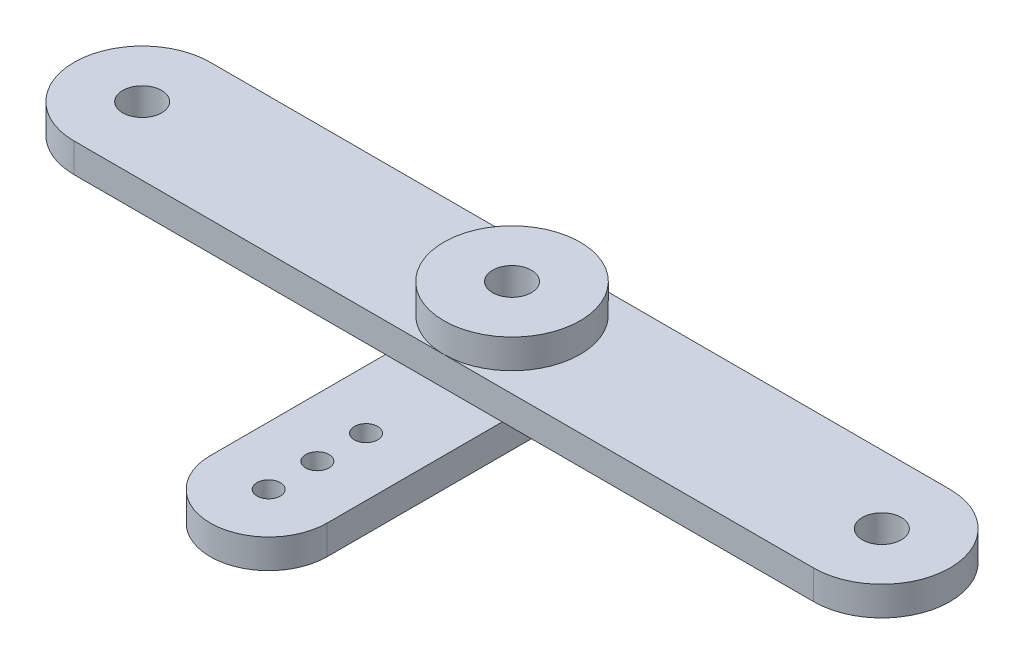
ISO-10303-21;
HEADER;
FILE_DESCRIPTION(('STEP AP214'),'2;1');
FILE_NAME('part.step','',(''),(''),'','','');
FILE_SCHEMA(('AUTOMOTIVE_DESIGN { 1 0 10303 214 1 1 1 1 }'));
ENDSEC;
DATA;
#1=APPLICATION_CONTEXT('core data for automotive mechanical design processes');
#2=APPLICATION_PROTOCOL_DEFINITION('international standard','automotive_design',2000,#1);
#3=PRODUCT_CONTEXT('',#1,'mechanical');
#4=PRODUCT('Part','Part','',(#3));
#5=PRODUCT_RELATED_PRODUCT_CATEGORY('part','',(#4));
#6=PRODUCT_DEFINITION_FORMATION('','',#4);
#7=PRODUCT_DEFINITION_CONTEXT('part definition',#1,'design');
#8=PRODUCT_DEFINITION('design','',#6,#7);
#9=PRODUCT_DEFINITION_SHAPE('','',#8);
#10=(LENGTH_UNIT() NAMED_UNIT(*) SI_UNIT(.MILLI.,.METRE.));
#11=(NAMED_UNIT(*) PLANE_ANGLE_UNIT() SI_UNIT($,.RADIAN.));
#12=(NAMED_UNIT(*) SI_UNIT($,.STERADIAN.) SOLID_ANGLE_UNIT());
#13=UNCERTAINTY_MEASURE_WITH_UNIT(LENGTH_MEASURE(1.E-05),#10,'distance_accuracy_value','');
#14=(GEOMETRIC_REPRESENTATION_CONTEXT(3) GLOBAL_UNCERTAINTY_ASSIGNED_CONTEXT((#13)) GLOBAL_UNIT_ASSIGNED_CONTEXT((#10,
#11,#12)) REPRESENTATION_CONTEXT('',''));
#15=CARTESIAN_POINT('',(0.,0.,0.));
#16=DIRECTION('',(0.,0.,1.));
#17=DIRECTION('',(1.,0.,0.));
#18=AXIS2_PLACEMENT_3D('',#15,#16,#17);
#19=CARTESIAN_POINT('',(19.,0.,0.));
#20=DIRECTION('',(0.,1.,0.));
#21=DIRECTION('',(0.,0.,1.));
#22=AXIS2_PLACEMENT_3D('',#19,#20,#21);
#23=PLANE('',#22);
#24=CARTESIAN_POINT('',(19.,0.,0.));
#25=DIRECTION('',(0.,1.,0.));
#26=DIRECTION('',(0.,0.,1.));
#27=AXIS2_PLACEMENT_3D('',#24,#25,#26);
#28=CIRCLE('',#27,1.);
#29=CARTESIAN_POINT('',(19.,0.,1.));
#30=VERTEX_POINT('',#29);
#31=EDGE_CURVE('E156',#30,#30,#28,.T.);
#32=ORIENTED_EDGE('',*,*,#31,.T.);
#33=EDGE_LOOP('',(#32));
#34=FACE_BOUND('',#33,.T.);
#35=DIRECTION('',(0.,0.,1.));
#36=VECTOR('',#35,1.);
#37=CARTESIAN_POINT('',(3.,0.,12.5));
#38=LINE('',#37,#36);
#39=CARTESIAN_POINT('',(3.,0.,-3.5));
#40=VERTEX_POINT('',#39);
#41=CARTESIAN_POINT('',(3.,0.,3.5));
#42=VERTEX_POINT('',#41);
#43=EDGE_CURVE('E49',#40,#42,#38,.T.);
#44=ORIENTED_EDGE('',*,*,#43,.F.);
#45=DIRECTION('',(-1.,0.,0.));
#46=VECTOR('',#45,1.);
#47=CARTESIAN_POINT('',(-19.,0.,-3.5));
#48=LINE('',#47,#46);
#49=CARTESIAN_POINT('',(19.,0.,-3.5));
#50=VERTEX_POINT('',#49);
#51=EDGE_CURVE('E189',#50,#40,#48,.T.);
#52=ORIENTED_EDGE('',*,*,#51,.F.);
#53=CARTESIAN_POINT('',(19.,0.,0.));
#54=DIRECTION('',(0.,1.,0.));
#55=DIRECTION('',(0.,0.,1.));
#56=AXIS2_PLACEMENT_3D('',#53,#54,#55);
#57=CIRCLE('',#56,3.5);
#58=CARTESIAN_POINT('',(19.,0.,3.5));
#59=VERTEX_POINT('',#58);
#60=EDGE_CURVE('E162',#59,#50,#57,.T.);
#61=ORIENTED_EDGE('',*,*,#60,.F.);
#62=DIRECTION('',(1.,0.,0.));
#63=VECTOR('',#62,1.);
#64=CARTESIAN_POINT('',(-19.,0.,3.5));
#65=LINE('',#64,#63);
#66=EDGE_CURVE('E54',#42,#59,#65,.T.);
#67=ORIENTED_EDGE('',*,*,#66,.F.);
#68=EDGE_LOOP('',(#44,#52,#61,#67));
#69=FACE_BOUND('',#68,.T.);
#70=ADVANCED_FACE('F32',(#34,#69),#23,.F.);
#71=CARTESIAN_POINT('',(-19.,0.,0.));
#72=DIRECTION('',(0.,1.,0.));
#73=DIRECTION('',(0.,0.,-1.));
#74=AXIS2_PLACEMENT_3D('',#71,#72,#73);
#75=CIRCLE('',#74,1.);
#76=CARTESIAN_POINT('',(-19.,0.,-1.));
#77=VERTEX_POINT('',#76);
#78=EDGE_CURVE('E150',#77,#77,#75,.T.);
#79=ORIENTED_EDGE('',*,*,#78,.T.);
#80=EDGE_LOOP('',(#79));
#81=FACE_BOUND('',#80,.T.);
#82=DIRECTION('',(0.,0.,-1.));
#83=VECTOR('',#82,1.);
#84=CARTESIAN_POINT('',(-3.,0.,-3.5));
#85=LINE('',#84,#83);
#86=CARTESIAN_POINT('',(-3.,0.,3.5));
#87=VERTEX_POINT('',#86);
#88=CARTESIAN_POINT('',(-3.,0.,-3.5));
#89=VERTEX_POINT('',#88);
#90=EDGE_CURVE('E11',#87,#89,#85,.T.);
#91=ORIENTED_EDGE('',*,*,#90,.F.);
#92=CARTESIAN_POINT('',(-19.,0.,3.5));
#93=VERTEX_POINT('',#92);
#94=EDGE_CURVE('E169',#93,#87,#65,.T.);
#95=ORIENTED_EDGE('',*,*,#94,.F.);
#96=CARTESIAN_POINT('',(-19.,0.,0.));
#97=DIRECTION('',(0.,1.,0.));
#98=DIRECTION('',(0.,0.,-1.));
#99=AXIS2_PLACEMENT_3D('',#96,#97,#98);
#100=CIRCLE('',#99,3.5);
#101=CARTESIAN_POINT('',(-19.,0.,-3.5));
#102=VERTEX_POINT('',#101);
#103=EDGE_CURVE('E184',#102,#93,#100,.T.);
#104=ORIENTED_EDGE('',*,*,#103,.F.);
#105=EDGE_CURVE('E181',#89,#102,#48,.T.);
#106=ORIENTED_EDGE('',*,*,#105,.F.);
#107=EDGE_LOOP('',(#91,#95,#104,#106));
#108=FACE_BOUND('',#107,.T.);
#109=ADVANCED_FACE('F217',(#81,#108),#23,.F.);
#110=CARTESIAN_POINT('',(19.,1.5,0.));
#111=DIRECTION('',(0.,1.,0.));
#112=DIRECTION('',(0.,0.,1.));
#113=AXIS2_PLACEMENT_3D('',#110,#111,#112);
#114=PLANE('',#113);
#115=CARTESIAN_POINT('',(0.,1.5,0.));
#116=DIRECTION('',(0.,1.,0.));
#117=DIRECTION('',(0.,0.,1.));
#118=AXIS2_PLACEMENT_3D('',#115,#116,#117);
#119=CIRCLE('',#118,3.5);
#120=CARTESIAN_POINT('',(0.,1.5,3.5));
#121=VERTEX_POINT('',#120);
#122=CARTESIAN_POINT('',(0.,1.5,-3.5));
#123=VERTEX_POINT('',#122);
#124=EDGE_CURVE('E139',#121,#123,#119,.T.);
#125=ORIENTED_EDGE('',*,*,#124,.F.);
#126=DIRECTION('',(1.,0.,0.));
#127=VECTOR('',#126,1.);
#128=CARTESIAN_POINT('',(-19.,1.5,3.5));
#129=LINE('',#128,#127);
#130=CARTESIAN_POINT('',(19.,1.5,3.5));
#131=VERTEX_POINT('',#130);
#132=EDGE_CURVE('E175',#121,#131,#129,.T.);
#133=ORIENTED_EDGE('',*,*,#132,.T.);
#134=CARTESIAN_POINT('',(19.,1.5,0.));
#135=DIRECTION('',(0.,1.,0.));
#136=DIRECTION('',(0.,0.,1.));
#137=AXIS2_PLACEMENT_3D('',#134,#135,#136);
#138=CIRCLE('',#137,3.5);
#139=CARTESIAN_POINT('',(19.,1.5,-3.5));
#140=VERTEX_POINT('',#139);
#141=EDGE_CURVE('E165',#131,#140,#138,.T.);
#142=ORIENTED_EDGE('',*,*,#141,.T.);
#143=DIRECTION('',(-1.,0.,0.));
#144=VECTOR('',#143,1.);
#145=CARTESIAN_POINT('',(-19.,1.5,-3.5));
#146=LINE('',#145,#144);
#147=EDGE_CURVE('E170',#140,#123,#146,.T.);
#148=ORIENTED_EDGE('',*,*,#147,.T.);
#149=EDGE_LOOP('',(#125,#133,#142,#148));
#150=FACE_BOUND('',#149,.T.);
#151=CARTESIAN_POINT('',(19.,1.5,0.));
#152=DIRECTION('',(0.,1.,0.));
#153=DIRECTION('',(0.,0.,1.));
#154=AXIS2_PLACEMENT_3D('',#151,#152,#153);
#155=CIRCLE('',#154,1.);
#156=CARTESIAN_POINT('',(19.,1.5,1.));
#157=VERTEX_POINT('',#156);
#158=EDGE_CURVE('E159',#157,#157,#155,.T.);
#159=ORIENTED_EDGE('',*,*,#158,.F.);
#160=EDGE_LOOP('',(#159));
#161=FACE_BOUND('',#160,.T.);
#162=ADVANCED_FACE('F258',(#150,#161),#114,.T.);
#163=EDGE_CURVE('E41',#123,#121,#119,.T.);
#164=ORIENTED_EDGE('',*,*,#163,.F.);
#165=CARTESIAN_POINT('',(-19.,1.5,-3.5));
#166=VERTEX_POINT('',#165);
#167=EDGE_CURVE('E168',#123,#166,#146,.T.);
#168=ORIENTED_EDGE('',*,*,#167,.T.);
#169=CARTESIAN_POINT('',(-19.,1.5,0.));
#170=DIRECTION('',(0.,1.,0.));
#171=DIRECTION('',(0.,0.,-1.));
#172=AXIS2_PLACEMENT_3D('',#169,#170,#171);
#173=CIRCLE('',#172,3.5);
#174=CARTESIAN_POINT('',(-19.,1.5,3.5));
#175=VERTEX_POINT('',#174);
#176=EDGE_CURVE('E173',#166,#175,#173,.T.);
#177=ORIENTED_EDGE('',*,*,#176,.T.);
#178=EDGE_CURVE('E176',#175,#121,#129,.T.);
#179=ORIENTED_EDGE('',*,*,#178,.T.);
#180=EDGE_LOOP('',(#164,#168,#177,#179));
#181=FACE_BOUND('',#180,.T.);
#182=CARTESIAN_POINT('',(-19.,1.5,0.));
#183=DIRECTION('',(0.,1.,0.));
#184=DIRECTION('',(0.,0.,-1.));
#185=AXIS2_PLACEMENT_3D('',#182,#183,#184);
#186=CIRCLE('',#185,1.);
#187=CARTESIAN_POINT('',(-19.,1.5,-1.));
#188=VERTEX_POINT('',#187);
#189=EDGE_CURVE('E153',#188,#188,#186,.T.);
#190=ORIENTED_EDGE('',*,*,#189,.F.);
#191=EDGE_LOOP('',(#190));
#192=FACE_BOUND('',#191,.T.);
#193=ADVANCED_FACE('F262',(#181,#192),#114,.T.);
#194=CARTESIAN_POINT('',(19.,1.5,0.));
#195=DIRECTION('',(0.,-1.,0.));
#196=DIRECTION('',(0.,0.,-1.));
#197=AXIS2_PLACEMENT_3D('',#194,#195,#196);
#198=CYLINDRICAL_SURFACE('',#197,3.5);
#199=ORIENTED_EDGE('',*,*,#60,.T.);
#200=DIRECTION('',(0.,-1.,0.));
#201=VECTOR('',#200,1.);
#202=CARTESIAN_POINT('',(19.,1.5,-3.5));
#203=LINE('',#202,#201);
#204=EDGE_CURVE('E191',#140,#50,#203,.T.);
#205=ORIENTED_EDGE('',*,*,#204,.F.);
#206=ORIENTED_EDGE('',*,*,#141,.F.);
#207=DIRECTION('',(0.,-1.,0.));
#208=VECTOR('',#207,1.);
#209=CARTESIAN_POINT('',(19.,1.5,3.5));
#210=LINE('',#209,#208);
#211=EDGE_CURVE('E178',#131,#59,#210,.T.);
#212=ORIENTED_EDGE('',*,*,#211,.T.);
#213=EDGE_LOOP('',(#199,#205,#206,#212));
#214=FACE_BOUND('',#213,.T.);
#215=ADVANCED_FACE('F34',(#214),#198,.T.);
#216=CARTESIAN_POINT('',(-19.,1.5,-3.5));
#217=DIRECTION('',(0.,0.,1.));
#218=DIRECTION('',(1.,0.,0.));
#219=AXIS2_PLACEMENT_3D('',#216,#217,#218);
#220=PLANE('',#219);
#221=ORIENTED_EDGE('',*,*,#51,.T.);
#222=DIRECTION('',(0.,1.,0.));
#223=VECTOR('',#222,1.);
#224=CARTESIAN_POINT('',(3.,-1.5,-3.5));
#225=LINE('',#224,#223);
#226=CARTESIAN_POINT('',(3.,-1.5,-3.5));
#227=VERTEX_POINT('',#226);
#228=EDGE_CURVE('E141',#227,#40,#225,.T.);
#229=ORIENTED_EDGE('',*,*,#228,.F.);
#230=DIRECTION('',(1.,0.,0.));
#231=VECTOR('',#230,1.);
#232=CARTESIAN_POINT('',(3.,-1.5,-3.5));
#233=LINE('',#232,#231);
#234=CARTESIAN_POINT('',(-3.,-1.5,-3.5));
#235=VERTEX_POINT('',#234);
#236=EDGE_CURVE('E121',#235,#227,#233,.T.);
#237=ORIENTED_EDGE('',*,*,#236,.F.);
#238=DIRECTION('',(0.,1.,0.));
#239=VECTOR('',#238,1.);
#240=CARTESIAN_POINT('',(-3.,-1.5,-3.5));
#241=LINE('',#240,#239);
#242=EDGE_CURVE('E118',#235,#89,#241,.T.);
#243=ORIENTED_EDGE('',*,*,#242,.T.);
#244=ORIENTED_EDGE('',*,*,#105,.T.);
#245=DIRECTION('',(0.,-1.,0.));
#246=VECTOR('',#245,1.);
#247=CARTESIAN_POINT('',(-19.,1.5,-3.5));
#248=LINE('',#247,#246);
#249=EDGE_CURVE('E194',#166,#102,#248,.T.);
#250=ORIENTED_EDGE('',*,*,#249,.F.);
#251=ORIENTED_EDGE('',*,*,#167,.F.);
#252=ORIENTED_EDGE('',*,*,#147,.F.);
#253=ORIENTED_EDGE('',*,*,#204,.T.);
#254=EDGE_LOOP('',(#221,#229,#237,#243,#244,#250,#251,#252,#253));
#255=FACE_BOUND('',#254,.T.);
#256=ADVANCED_FACE('F220',(#255),#220,.F.);
#257=CARTESIAN_POINT('',(-19.,1.5,0.));
#258=DIRECTION('',(0.,-1.,0.));
#259=DIRECTION('',(0.,0.,-1.));
#260=AXIS2_PLACEMENT_3D('',#257,#258,#259);
#261=CYLINDRICAL_SURFACE('',#260,3.5);
#262=ORIENTED_EDGE('',*,*,#103,.T.);
#263=DIRECTION('',(0.,-1.,0.));
#264=VECTOR('',#263,1.);
#265=CARTESIAN_POINT('',(-19.,1.5,3.5));
#266=LINE('',#265,#264);
#267=EDGE_CURVE('E197',#175,#93,#266,.T.);
#268=ORIENTED_EDGE('',*,*,#267,.F.);
#269=ORIENTED_EDGE('',*,*,#176,.F.);
#270=ORIENTED_EDGE('',*,*,#249,.T.);
#271=EDGE_LOOP('',(#262,#268,#269,#270));
#272=FACE_BOUND('',#271,.T.);
#273=ADVANCED_FACE('F210',(#272),#261,.T.);
#274=CARTESIAN_POINT('',(-19.,1.5,3.5));
#275=DIRECTION('',(0.,0.,-1.));
#276=DIRECTION('',(-1.,0.,0.));
#277=AXIS2_PLACEMENT_3D('',#274,#275,#276);
#278=PLANE('',#277);
#279=ORIENTED_EDGE('',*,*,#94,.T.);
#280=EDGE_CURVE('E202',#87,#42,#65,.T.);
#281=ORIENTED_EDGE('',*,*,#280,.T.);
#282=ORIENTED_EDGE('',*,*,#66,.T.);
#283=ORIENTED_EDGE('',*,*,#211,.F.);
#284=ORIENTED_EDGE('',*,*,#132,.F.);
#285=ORIENTED_EDGE('',*,*,#178,.F.);
#286=ORIENTED_EDGE('',*,*,#267,.T.);
#287=EDGE_LOOP('',(#279,#281,#282,#283,#284,#285,#286));
#288=FACE_BOUND('',#287,.T.);
#289=ADVANCED_FACE('F215',(#288),#278,.F.);
#290=CARTESIAN_POINT('',(19.,1.5,0.));
#291=DIRECTION('',(0.,-1.,0.));
#292=DIRECTION('',(0.,0.,-1.));
#293=AXIS2_PLACEMENT_3D('',#290,#291,#292);
#294=CYLINDRICAL_SURFACE('',#293,1.);
#295=ORIENTED_EDGE('',*,*,#158,.T.);
#296=EDGE_LOOP('',(#295));
#297=FACE_BOUND('',#296,.T.);
#298=ORIENTED_EDGE('',*,*,#31,.F.);
#299=EDGE_LOOP('',(#298));
#300=FACE_BOUND('',#299,.T.);
#301=ADVANCED_FACE('F266',(#297,#300),#294,.F.);
#302=CARTESIAN_POINT('',(-19.,1.5,0.));
#303=DIRECTION('',(0.,-1.,0.));
#304=DIRECTION('',(0.,0.,-1.));
#305=AXIS2_PLACEMENT_3D('',#302,#303,#304);
#306=CYLINDRICAL_SURFACE('',#305,1.);
#307=ORIENTED_EDGE('',*,*,#189,.T.);
#308=EDGE_LOOP('',(#307));
#309=FACE_BOUND('',#308,.T.);
#310=ORIENTED_EDGE('',*,*,#78,.F.);
#311=EDGE_LOOP('',(#310));
#312=FACE_BOUND('',#311,.T.);
#313=ADVANCED_FACE('F289',(#309,#312),#306,.F.);
#314=CARTESIAN_POINT('',(0.,1.5,0.));
#315=DIRECTION('',(0.,-1.,0.));
#316=DIRECTION('',(0.,0.,-1.));
#317=AXIS2_PLACEMENT_3D('',#314,#315,#316);
#318=CYLINDRICAL_SURFACE('',#317,1.);
#319=CARTESIAN_POINT('',(0.,3.,0.));
#320=DIRECTION('',(0.,1.,0.));
#321=DIRECTION('',(0.,0.,1.));
#322=AXIS2_PLACEMENT_3D('',#319,#320,#321);
#323=CIRCLE('',#322,1.);
#324=CARTESIAN_POINT('',(0.,3.,1.));
#325=VERTEX_POINT('',#324);
#326=EDGE_CURVE('E136',#325,#325,#323,.T.);
#327=ORIENTED_EDGE('',*,*,#326,.T.);
#328=EDGE_LOOP('',(#327));
#329=FACE_BOUND('',#328,.T.);
#330=CARTESIAN_POINT('',(0.,-1.5,0.));
#331=DIRECTION('',(0.,-1.,0.));
#332=DIRECTION('',(0.,0.,-1.));
#333=AXIS2_PLACEMENT_3D('',#330,#331,#332);
#334=CIRCLE('',#333,1.);
#335=CARTESIAN_POINT('',(0.,-1.5,-1.));
#336=VERTEX_POINT('',#335);
#337=EDGE_CURVE('E343',#336,#336,#334,.T.);
#338=ORIENTED_EDGE('',*,*,#337,.T.);
#339=EDGE_LOOP('',(#338));
#340=FACE_BOUND('',#339,.T.);
#341=ADVANCED_FACE('F292',(#329,#340),#318,.F.);
#342=CARTESIAN_POINT('',(0.,3.,0.));
#343=DIRECTION('',(0.,1.,0.));
#344=DIRECTION('',(0.,0.,1.));
#345=AXIS2_PLACEMENT_3D('',#342,#343,#344);
#346=PLANE('',#345);
#347=CARTESIAN_POINT('',(0.,3.,0.));
#348=DIRECTION('',(0.,1.,0.));
#349=DIRECTION('',(0.,0.,1.));
#350=AXIS2_PLACEMENT_3D('',#347,#348,#349);
#351=CIRCLE('',#350,3.5);
#352=CARTESIAN_POINT('',(0.,3.,3.5));
#353=VERTEX_POINT('',#352);
#354=EDGE_CURVE('E147',#353,#353,#351,.T.);
#355=ORIENTED_EDGE('',*,*,#354,.T.);
#356=EDGE_LOOP('',(#355));
#357=FACE_BOUND('',#356,.T.);
#358=ORIENTED_EDGE('',*,*,#326,.F.);
#359=EDGE_LOOP('',(#358));
#360=FACE_BOUND('',#359,.T.);
#361=ADVANCED_FACE('F299',(#357,#360),#346,.T.);
#362=CARTESIAN_POINT('',(0.,3.,0.));
#363=DIRECTION('',(0.,-1.,0.));
#364=DIRECTION('',(0.,0.,-1.));
#365=AXIS2_PLACEMENT_3D('',#362,#363,#364);
#366=CYLINDRICAL_SURFACE('',#365,3.5);
#367=ORIENTED_EDGE('',*,*,#354,.F.);
#368=EDGE_LOOP('',(#367));
#369=FACE_BOUND('',#368,.T.);
#370=ORIENTED_EDGE('',*,*,#124,.T.);
#371=ORIENTED_EDGE('',*,*,#163,.T.);
#372=EDGE_LOOP('',(#370,#371));
#373=FACE_BOUND('',#372,.T.);
#374=ADVANCED_FACE('F285',(#369,#373),#366,.T.);
#375=CARTESIAN_POINT('',(0.,-1.5,12.5));
#376=DIRECTION('',(0.,-1.,0.));
#377=DIRECTION('',(0.,0.,-1.));
#378=AXIS2_PLACEMENT_3D('',#375,#376,#377);
#379=PLANE('',#378);
#380=CARTESIAN_POINT('',(0.,-1.5,9.99999999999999));
#381=DIRECTION('',(0.,-1.,0.));
#382=DIRECTION('',(0.,0.,-1.));
#383=AXIS2_PLACEMENT_3D('',#380,#381,#382);
#384=CIRCLE('',#383,0.6);
#385=CARTESIAN_POINT('',(0.,-1.5,9.39999999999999));
#386=VERTEX_POINT('',#385);
#387=EDGE_CURVE('E340',#386,#386,#384,.T.);
#388=ORIENTED_EDGE('',*,*,#387,.F.);
#389=EDGE_LOOP('',(#388));
#390=FACE_BOUND('',#389,.T.);
#391=CARTESIAN_POINT('',(0.,-1.5,12.5));
#392=DIRECTION('',(0.,-1.,0.));
#393=DIRECTION('',(0.,0.,-1.));
#394=AXIS2_PLACEMENT_3D('',#391,#392,#393);
#395=CIRCLE('',#394,0.6);
#396=CARTESIAN_POINT('',(0.,-1.5,11.9));
#397=VERTEX_POINT('',#396);
#398=EDGE_CURVE('E227',#397,#397,#395,.T.);
#399=ORIENTED_EDGE('',*,*,#398,.F.);
#400=EDGE_LOOP('',(#399));
#401=FACE_BOUND('',#400,.T.);
#402=CARTESIAN_POINT('',(0.,-1.5,12.5));
#403=DIRECTION('',(0.,-1.,0.));
#404=DIRECTION('',(0.,0.,-1.));
#405=AXIS2_PLACEMENT_3D('',#402,#403,#404);
#406=CIRCLE('',#405,3.);
#407=CARTESIAN_POINT('',(3.,-1.5,12.5));
#408=VERTEX_POINT('',#407);
#409=CARTESIAN_POINT('',(-3.,-1.5,12.5));
#410=VERTEX_POINT('',#409);
#411=EDGE_CURVE('E122',#408,#410,#406,.T.);
#412=ORIENTED_EDGE('',*,*,#411,.T.);
#413=DIRECTION('',(0.,0.,-1.));
#414=VECTOR('',#413,1.);
#415=CARTESIAN_POINT('',(-3.,-1.5,-3.5));
#416=LINE('',#415,#414);
#417=EDGE_CURVE('E110',#410,#235,#416,.T.);
#418=ORIENTED_EDGE('',*,*,#417,.T.);
#419=ORIENTED_EDGE('',*,*,#236,.T.);
#420=DIRECTION('',(0.,0.,1.));
#421=VECTOR('',#420,1.);
#422=CARTESIAN_POINT('',(3.,-1.5,12.5));
#423=LINE('',#422,#421);
#424=EDGE_CURVE('E128',#227,#408,#423,.T.);
#425=ORIENTED_EDGE('',*,*,#424,.T.);
#426=EDGE_LOOP('',(#412,#418,#419,#425));
#427=FACE_BOUND('',#426,.T.);
#428=ORIENTED_EDGE('',*,*,#337,.F.);
#429=EDGE_LOOP('',(#428));
#430=FACE_BOUND('',#429,.T.);
#431=CARTESIAN_POINT('',(0.,-1.5,7.49999999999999));
#432=DIRECTION('',(0.,-1.,0.));
#433=DIRECTION('',(0.,0.,-1.));
#434=AXIS2_PLACEMENT_3D('',#431,#432,#433);
#435=CIRCLE('',#434,0.6);
#436=CARTESIAN_POINT('',(0.,-1.5,6.89999999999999));
#437=VERTEX_POINT('',#436);
#438=EDGE_CURVE('E331',#437,#437,#435,.T.);
#439=ORIENTED_EDGE('',*,*,#438,.F.);
#440=EDGE_LOOP('',(#439));
#441=FACE_BOUND('',#440,.T.);
#442=ADVANCED_FACE('F125',(#390,#401,#427,#430,#441),#379,.T.);
#443=CARTESIAN_POINT('',(0.,0.,12.5));
#444=DIRECTION('',(0.,-1.,0.));
#445=DIRECTION('',(0.,0.,-1.));
#446=AXIS2_PLACEMENT_3D('',#443,#444,#445);
#447=PLANE('',#446);
#448=ORIENTED_EDGE('',*,*,#280,.F.);
#449=CARTESIAN_POINT('',(-3.,0.,12.5));
#450=VERTEX_POINT('',#449);
#451=EDGE_CURVE('E218',#450,#87,#85,.T.);
#452=ORIENTED_EDGE('',*,*,#451,.F.);
#453=CARTESIAN_POINT('',(0.,0.,12.5));
#454=DIRECTION('',(0.,-1.,0.));
#455=DIRECTION('',(0.,0.,-1.));
#456=AXIS2_PLACEMENT_3D('',#453,#454,#455);
#457=CIRCLE('',#456,3.);
#458=CARTESIAN_POINT('',(3.,0.,12.5));
#459=VERTEX_POINT('',#458);
#460=EDGE_CURVE('E135',#459,#450,#457,.T.);
#461=ORIENTED_EDGE('',*,*,#460,.F.);
#462=EDGE_CURVE('E229',#42,#459,#38,.T.);
#463=ORIENTED_EDGE('',*,*,#462,.F.);
#464=EDGE_LOOP('',(#448,#452,#461,#463));
#465=FACE_BOUND('',#464,.T.);
#466=CARTESIAN_POINT('',(0.,0.,9.99999999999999));
#467=DIRECTION('',(0.,-1.,0.));
#468=DIRECTION('',(0.,0.,-1.));
#469=AXIS2_PLACEMENT_3D('',#466,#467,#468);
#470=CIRCLE('',#469,0.6);
#471=CARTESIAN_POINT('',(0.,0.,9.39999999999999));
#472=VERTEX_POINT('',#471);
#473=EDGE_CURVE('E337',#472,#472,#470,.T.);
#474=ORIENTED_EDGE('',*,*,#473,.T.);
#475=EDGE_LOOP('',(#474));
#476=FACE_BOUND('',#475,.T.);
#477=CARTESIAN_POINT('',(0.,0.,12.5));
#478=DIRECTION('',(0.,-1.,0.));
#479=DIRECTION('',(0.,0.,-1.));
#480=AXIS2_PLACEMENT_3D('',#477,#478,#479);
#481=CIRCLE('',#480,0.6);
#482=CARTESIAN_POINT('',(0.,0.,11.9));
#483=VERTEX_POINT('',#482);
#484=EDGE_CURVE('E348',#483,#483,#481,.T.);
#485=ORIENTED_EDGE('',*,*,#484,.T.);
#486=EDGE_LOOP('',(#485));
#487=FACE_BOUND('',#486,.T.);
#488=CARTESIAN_POINT('',(0.,0.,7.49999999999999));
#489=DIRECTION('',(0.,-1.,0.));
#490=DIRECTION('',(0.,0.,-1.));
#491=AXIS2_PLACEMENT_3D('',#488,#489,#490);
#492=CIRCLE('',#491,0.6);
#493=CARTESIAN_POINT('',(0.,0.,6.89999999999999));
#494=VERTEX_POINT('',#493);
#495=EDGE_CURVE('E334',#494,#494,#492,.T.);
#496=ORIENTED_EDGE('',*,*,#495,.T.);
#497=EDGE_LOOP('',(#496));
#498=FACE_BOUND('',#497,.T.);
#499=ADVANCED_FACE('F237',(#465,#476,#487,#498),#447,.F.);
#500=CARTESIAN_POINT('',(0.,-1.5,12.5));
#501=DIRECTION('',(0.,1.,0.));
#502=DIRECTION('',(0.,0.,1.));
#503=AXIS2_PLACEMENT_3D('',#500,#501,#502);
#504=CYLINDRICAL_SURFACE('',#503,3.);
#505=ORIENTED_EDGE('',*,*,#460,.T.);
#506=DIRECTION('',(0.,1.,0.));
#507=VECTOR('',#506,1.);
#508=CARTESIAN_POINT('',(-3.,-1.5,12.5));
#509=LINE('',#508,#507);
#510=EDGE_CURVE('E115',#410,#450,#509,.T.);
#511=ORIENTED_EDGE('',*,*,#510,.F.);
#512=ORIENTED_EDGE('',*,*,#411,.F.);
#513=DIRECTION('',(0.,1.,0.));
#514=VECTOR('',#513,1.);
#515=CARTESIAN_POINT('',(3.,-1.5,12.5));
#516=LINE('',#515,#514);
#517=EDGE_CURVE('E144',#408,#459,#516,.T.);
#518=ORIENTED_EDGE('',*,*,#517,.T.);
#519=EDGE_LOOP('',(#505,#511,#512,#518));
#520=FACE_BOUND('',#519,.T.);
#521=ADVANCED_FACE('F133',(#520),#504,.T.);
#522=CARTESIAN_POINT('',(-3.,-1.5,-3.5));
#523=DIRECTION('',(1.,0.,0.));
#524=DIRECTION('',(0.,0.,-1.));
#525=AXIS2_PLACEMENT_3D('',#522,#523,#524);
#526=PLANE('',#525);
#527=ORIENTED_EDGE('',*,*,#451,.T.);
#528=ORIENTED_EDGE('',*,*,#90,.T.);
#529=ORIENTED_EDGE('',*,*,#242,.F.);
#530=ORIENTED_EDGE('',*,*,#417,.F.);
#531=ORIENTED_EDGE('',*,*,#510,.T.);
#532=EDGE_LOOP('',(#527,#528,#529,#530,#531));
#533=FACE_BOUND('',#532,.T.);
#534=ADVANCED_FACE('F113',(#533),#526,.F.);
#535=CARTESIAN_POINT('',(3.,-1.5,12.5));
#536=DIRECTION('',(-1.,0.,0.));
#537=DIRECTION('',(0.,0.,1.));
#538=AXIS2_PLACEMENT_3D('',#535,#536,#537);
#539=PLANE('',#538);
#540=ORIENTED_EDGE('',*,*,#43,.T.);
#541=ORIENTED_EDGE('',*,*,#462,.T.);
#542=ORIENTED_EDGE('',*,*,#517,.F.);
#543=ORIENTED_EDGE('',*,*,#424,.F.);
#544=ORIENTED_EDGE('',*,*,#228,.T.);
#545=EDGE_LOOP('',(#540,#541,#542,#543,#544));
#546=FACE_BOUND('',#545,.T.);
#547=ADVANCED_FACE('F239',(#546),#539,.F.);
#548=CARTESIAN_POINT('',(0.,-1.5,12.5));
#549=DIRECTION('',(0.,1.,0.));
#550=DIRECTION('',(0.,0.,1.));
#551=AXIS2_PLACEMENT_3D('',#548,#549,#550);
#552=CYLINDRICAL_SURFACE('',#551,0.6);
#553=ORIENTED_EDGE('',*,*,#398,.T.);
#554=EDGE_LOOP('',(#553));
#555=FACE_BOUND('',#554,.T.);
#556=ORIENTED_EDGE('',*,*,#484,.F.);
#557=EDGE_LOOP('',(#556));
#558=FACE_BOUND('',#557,.T.);
#559=ADVANCED_FACE('F241',(#555,#558),#552,.F.);
#560=CARTESIAN_POINT('',(0.,-1.5,9.99999999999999));
#561=DIRECTION('',(0.,1.,0.));
#562=DIRECTION('',(0.,0.,1.));
#563=AXIS2_PLACEMENT_3D('',#560,#561,#562);
#564=CYLINDRICAL_SURFACE('',#563,0.6);
#565=ORIENTED_EDGE('',*,*,#387,.T.);
#566=EDGE_LOOP('',(#565));
#567=FACE_BOUND('',#566,.T.);
#568=ORIENTED_EDGE('',*,*,#473,.F.);
#569=EDGE_LOOP('',(#568));
#570=FACE_BOUND('',#569,.T.);
#571=ADVANCED_FACE('F247',(#567,#570),#564,.F.);
#572=CARTESIAN_POINT('',(0.,-1.5,7.49999999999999));
#573=DIRECTION('',(0.,1.,0.));
#574=DIRECTION('',(0.,0.,1.));
#575=AXIS2_PLACEMENT_3D('',#572,#573,#574);
#576=CYLINDRICAL_SURFACE('',#575,0.6);
#577=ORIENTED_EDGE('',*,*,#438,.T.);
#578=EDGE_LOOP('',(#577));
#579=FACE_BOUND('',#578,.T.);
#580=ORIENTED_EDGE('',*,*,#495,.F.);
#581=EDGE_LOOP('',(#580));
#582=FACE_BOUND('',#581,.T.);
#583=ADVANCED_FACE('F322',(#579,#582),#576,.F.);
#584=CLOSED_SHELL('',(#70,#109,#162,#193,#215,#256,#273,#289,#301,#313,#341,#361,#374,#442,#499,
#521,#534,#547,#559,#571,#583));
#585=MANIFOLD_SOLID_BREP('B2',#584);
#586=ADVANCED_BREP_SHAPE_REPRESENTATION('',(#18,#585),#14);
#587=SHAPE_DEFINITION_REPRESENTATION(#9,#586);
ENDSEC;
END-ISO-10303-21;
